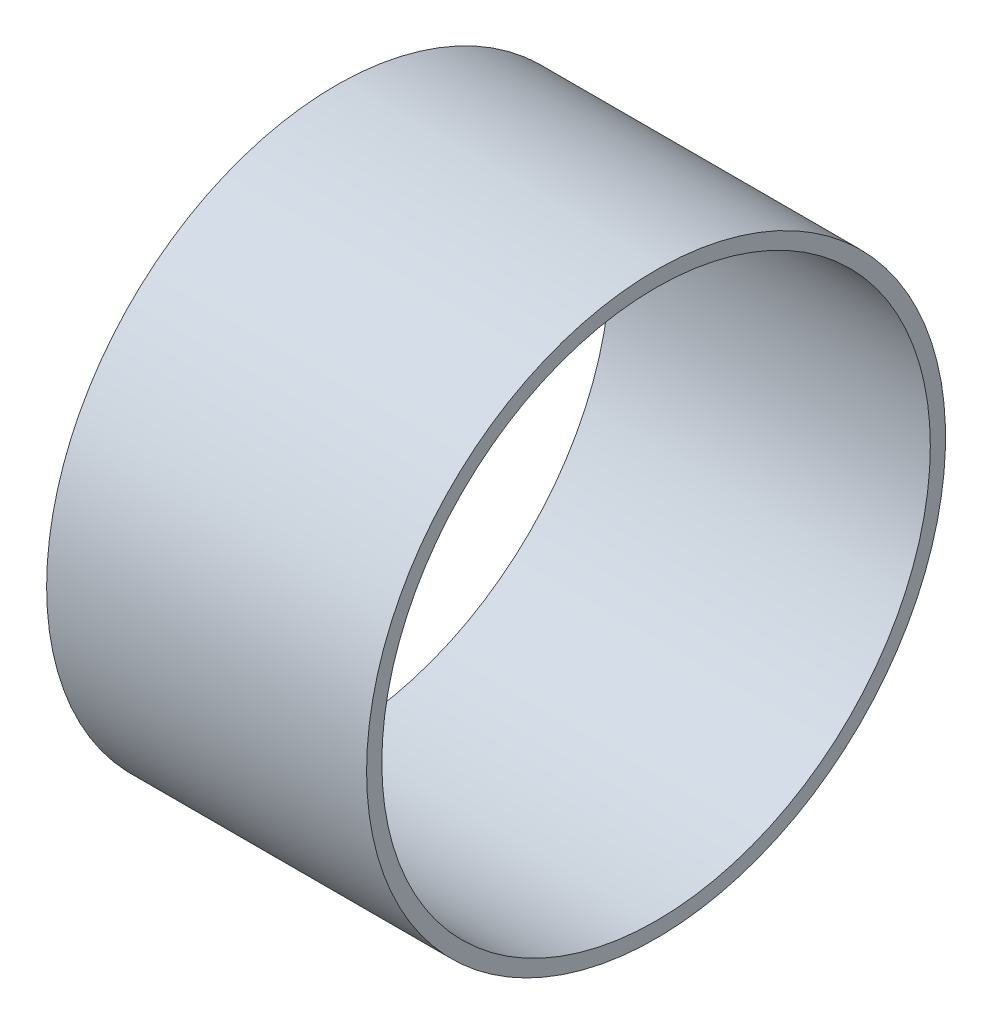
from build123d import *

# Parameters (mm, degrees)
ESQUISSE1_W = 42
ESQUISSE1_H = 2


with BuildPart() as part:
    # Esquisse1 → R_volution1 (revolve)
    with BuildSketch(Plane(origin=(0, 0, 0), x_dir=(-1, 0, 0), z_dir=(0, 0, -1)), mode=Mode.PRIVATE) as r_volution1_sk:
        with Locations((-21, 37)):
            Rectangle(ESQUISSE1_W, ESQUISSE1_H)
    revolve(r_volution1_sk.sketch.rotate(Axis((42, 0, 0), (-1, 0, 0)), 270), axis=Axis((42, 0, 0), (-1, 0, 0)))


solid = part.part
